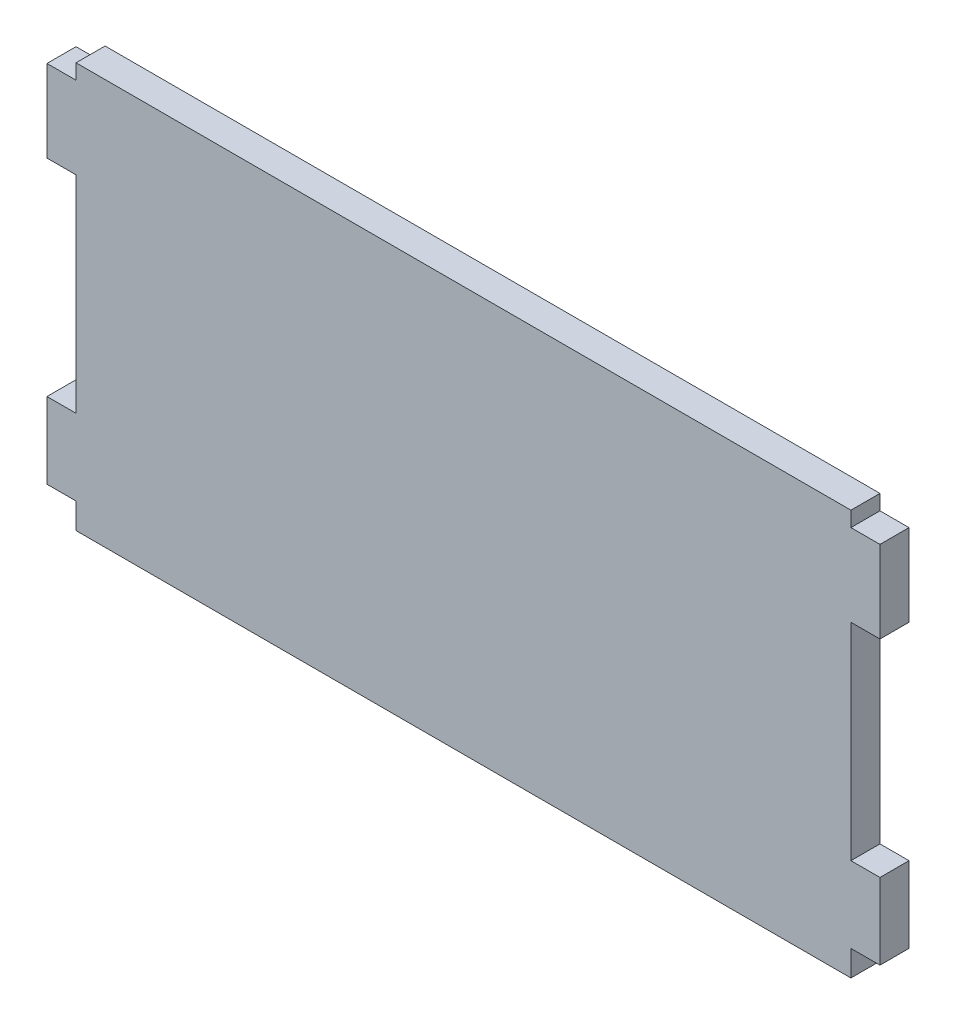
ISO-10303-21;
HEADER;
FILE_DESCRIPTION(('STEP AP214'),'2;1');
FILE_NAME('part.step','',(''),(''),'','','');
FILE_SCHEMA(('AUTOMOTIVE_DESIGN { 1 0 10303 214 1 1 1 1 }'));
ENDSEC;
DATA;
#1=APPLICATION_CONTEXT('core data for automotive mechanical design processes');
#2=APPLICATION_PROTOCOL_DEFINITION('international standard','automotive_design',2000,#1);
#3=PRODUCT_CONTEXT('',#1,'mechanical');
#4=PRODUCT('Part','Part','',(#3));
#5=PRODUCT_RELATED_PRODUCT_CATEGORY('part','',(#4));
#6=PRODUCT_DEFINITION_FORMATION('','',#4);
#7=PRODUCT_DEFINITION_CONTEXT('part definition',#1,'design');
#8=PRODUCT_DEFINITION('design','',#6,#7);
#9=PRODUCT_DEFINITION_SHAPE('','',#8);
#10=(LENGTH_UNIT() NAMED_UNIT(*) SI_UNIT(.MILLI.,.METRE.));
#11=(NAMED_UNIT(*) PLANE_ANGLE_UNIT() SI_UNIT($,.RADIAN.));
#12=(NAMED_UNIT(*) SI_UNIT($,.STERADIAN.) SOLID_ANGLE_UNIT());
#13=UNCERTAINTY_MEASURE_WITH_UNIT(LENGTH_MEASURE(1.E-05),#10,'distance_accuracy_value','');
#14=(GEOMETRIC_REPRESENTATION_CONTEXT(3) GLOBAL_UNCERTAINTY_ASSIGNED_CONTEXT((#13)) GLOBAL_UNIT_ASSIGNED_CONTEXT((#10,
#11,#12)) REPRESENTATION_CONTEXT('',''));
#15=CARTESIAN_POINT('',(0.,0.,0.));
#16=DIRECTION('',(0.,0.,1.));
#17=DIRECTION('',(1.,0.,0.));
#18=AXIS2_PLACEMENT_3D('',#15,#16,#17);
#19=CARTESIAN_POINT('',(80.,14.0214078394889,3.));
#20=DIRECTION('',(-1.,0.,0.));
#21=DIRECTION('',(0.,0.,1.));
#22=AXIS2_PLACEMENT_3D('',#19,#20,#21);
#23=PLANE('',#22);
#24=DIRECTION('',(0.,1.,0.));
#25=VECTOR('',#24,1.);
#26=CARTESIAN_POINT('',(80.,14.0214078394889,3.));
#27=LINE('',#26,#25);
#28=CARTESIAN_POINT('',(80.,-17.3181044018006,3.));
#29=VERTEX_POINT('',#28);
#30=CARTESIAN_POINT('',(80.,3.99896080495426,3.));
#31=VERTEX_POINT('',#30);
#32=EDGE_CURVE('E37',#29,#31,#27,.T.);
#33=ORIENTED_EDGE('',*,*,#32,.F.);
#34=DIRECTION('',(0.,0.,1.));
#35=VECTOR('',#34,1.);
#36=CARTESIAN_POINT('',(80.,-17.3181044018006,0.));
#37=LINE('',#36,#35);
#38=CARTESIAN_POINT('',(80.,-17.3181044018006,0.));
#39=VERTEX_POINT('',#38);
#40=EDGE_CURVE('E187',#39,#29,#37,.T.);
#41=ORIENTED_EDGE('',*,*,#40,.F.);
#42=DIRECTION('',(0.,1.,0.));
#43=VECTOR('',#42,1.);
#44=CARTESIAN_POINT('',(80.,14.0214078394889,0.));
#45=LINE('',#44,#43);
#46=CARTESIAN_POINT('',(80.,3.99896080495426,0.));
#47=VERTEX_POINT('',#46);
#48=EDGE_CURVE('E174',#39,#47,#45,.T.);
#49=ORIENTED_EDGE('',*,*,#48,.T.);
#50=DIRECTION('',(0.,0.,1.));
#51=VECTOR('',#50,1.);
#52=CARTESIAN_POINT('',(80.,3.99896080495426,0.));
#53=LINE('',#52,#51);
#54=EDGE_CURVE('E228',#47,#31,#53,.T.);
#55=ORIENTED_EDGE('',*,*,#54,.T.);
#56=EDGE_LOOP('',(#33,#41,#49,#55));
#57=FACE_BOUND('',#56,.T.);
#58=ADVANCED_FACE('F33',(#57),#23,.F.);
#59=DIRECTION('',(0.,0.,1.));
#60=VECTOR('',#59,1.);
#61=CARTESIAN_POINT('',(80.,12.4619497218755,0.));
#62=LINE('',#61,#60);
#63=CARTESIAN_POINT('',(80.,12.4619497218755,0.));
#64=VERTEX_POINT('',#63);
#65=CARTESIAN_POINT('',(80.,12.4619497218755,3.));
#66=VERTEX_POINT('',#65);
#67=EDGE_CURVE('E217',#64,#66,#62,.T.);
#68=ORIENTED_EDGE('',*,*,#67,.F.);
#69=CARTESIAN_POINT('',(80.,14.0214078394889,0.));
#70=VERTEX_POINT('',#69);
#71=EDGE_CURVE('E186',#64,#70,#45,.T.);
#72=ORIENTED_EDGE('',*,*,#71,.T.);
#73=DIRECTION('',(0.,0.,-1.));
#74=VECTOR('',#73,1.);
#75=CARTESIAN_POINT('',(80.,14.0214078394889,3.));
#76=LINE('',#75,#74);
#77=CARTESIAN_POINT('',(80.,14.0214078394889,3.));
#78=VERTEX_POINT('',#77);
#79=EDGE_CURVE('E313',#78,#70,#76,.T.);
#80=ORIENTED_EDGE('',*,*,#79,.F.);
#81=EDGE_CURVE('E296',#66,#78,#27,.T.);
#82=ORIENTED_EDGE('',*,*,#81,.F.);
#83=EDGE_LOOP('',(#68,#72,#80,#82));
#84=FACE_BOUND('',#83,.T.);
#85=ADVANCED_FACE('F319',(#84),#23,.F.);
#86=CARTESIAN_POINT('',(0.,14.0214078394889,3.));
#87=DIRECTION('',(1.,0.,0.));
#88=DIRECTION('',(0.,0.,-1.));
#89=AXIS2_PLACEMENT_3D('',#86,#87,#88);
#90=PLANE('',#89);
#91=DIRECTION('',(0.,-1.,0.));
#92=VECTOR('',#91,1.);
#93=CARTESIAN_POINT('',(0.,14.0214078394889,0.));
#94=LINE('',#93,#92);
#95=CARTESIAN_POINT('',(0.,3.99896080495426,0.));
#96=VERTEX_POINT('',#95);
#97=CARTESIAN_POINT('',(0.,-17.3181044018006,0.));
#98=VERTEX_POINT('',#97);
#99=EDGE_CURVE('E282',#96,#98,#94,.T.);
#100=ORIENTED_EDGE('',*,*,#99,.T.);
#101=DIRECTION('',(0.,0.,1.));
#102=VECTOR('',#101,1.);
#103=CARTESIAN_POINT('',(0.,-17.3181044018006,0.));
#104=LINE('',#103,#102);
#105=CARTESIAN_POINT('',(0.,-17.3181044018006,3.));
#106=VERTEX_POINT('',#105);
#107=EDGE_CURVE('E386',#98,#106,#104,.T.);
#108=ORIENTED_EDGE('',*,*,#107,.T.);
#109=DIRECTION('',(0.,-1.,0.));
#110=VECTOR('',#109,1.);
#111=CARTESIAN_POINT('',(0.,14.0214078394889,3.));
#112=LINE('',#111,#110);
#113=CARTESIAN_POINT('',(0.,3.99896080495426,3.));
#114=VERTEX_POINT('',#113);
#115=EDGE_CURVE('E265',#114,#106,#112,.T.);
#116=ORIENTED_EDGE('',*,*,#115,.F.);
#117=DIRECTION('',(0.,0.,1.));
#118=VECTOR('',#117,1.);
#119=CARTESIAN_POINT('',(0.,3.99896080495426,0.));
#120=LINE('',#119,#118);
#121=EDGE_CURVE('E359',#96,#114,#120,.T.);
#122=ORIENTED_EDGE('',*,*,#121,.F.);
#123=EDGE_LOOP('',(#100,#108,#116,#122));
#124=FACE_BOUND('',#123,.T.);
#125=ADVANCED_FACE('F328',(#124),#90,.F.);
#126=CARTESIAN_POINT('',(0.,-25.162309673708,3.));
#127=VERTEX_POINT('',#126);
#128=CARTESIAN_POINT('',(0.,-27.8080848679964,3.));
#129=VERTEX_POINT('',#128);
#130=EDGE_CURVE('E262',#127,#129,#112,.T.);
#131=ORIENTED_EDGE('',*,*,#130,.F.);
#132=DIRECTION('',(0.,0.,1.));
#133=VECTOR('',#132,1.);
#134=CARTESIAN_POINT('',(0.,-25.162309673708,0.));
#135=LINE('',#134,#133);
#136=CARTESIAN_POINT('',(0.,-25.162309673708,0.));
#137=VERTEX_POINT('',#136);
#138=EDGE_CURVE('E382',#137,#127,#135,.T.);
#139=ORIENTED_EDGE('',*,*,#138,.F.);
#140=CARTESIAN_POINT('',(0.,-27.8080848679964,0.));
#141=VERTEX_POINT('',#140);
#142=EDGE_CURVE('E266',#137,#141,#94,.T.);
#143=ORIENTED_EDGE('',*,*,#142,.T.);
#144=DIRECTION('',(0.,0.,-1.));
#145=VECTOR('',#144,1.);
#146=CARTESIAN_POINT('',(0.,-27.8080848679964,3.));
#147=LINE('',#146,#145);
#148=EDGE_CURVE('E11',#129,#141,#147,.T.);
#149=ORIENTED_EDGE('',*,*,#148,.F.);
#150=EDGE_LOOP('',(#131,#139,#143,#149));
#151=FACE_BOUND('',#150,.T.);
#152=ADVANCED_FACE('F333',(#151),#90,.F.);
#153=CARTESIAN_POINT('',(0.,14.0214078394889,0.));
#154=VERTEX_POINT('',#153);
#155=CARTESIAN_POINT('',(0.,12.4619497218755,0.));
#156=VERTEX_POINT('',#155);
#157=EDGE_CURVE('E284',#154,#156,#94,.T.);
#158=ORIENTED_EDGE('',*,*,#157,.T.);
#159=DIRECTION('',(0.,0.,1.));
#160=VECTOR('',#159,1.);
#161=CARTESIAN_POINT('',(0.,12.4619497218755,0.));
#162=LINE('',#161,#160);
#163=CARTESIAN_POINT('',(0.,12.4619497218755,3.));
#164=VERTEX_POINT('',#163);
#165=EDGE_CURVE('E347',#156,#164,#162,.T.);
#166=ORIENTED_EDGE('',*,*,#165,.T.);
#167=CARTESIAN_POINT('',(0.,14.0214078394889,3.));
#168=VERTEX_POINT('',#167);
#169=EDGE_CURVE('E279',#168,#164,#112,.T.);
#170=ORIENTED_EDGE('',*,*,#169,.F.);
#171=DIRECTION('',(0.,0.,-1.));
#172=VECTOR('',#171,1.);
#173=CARTESIAN_POINT('',(0.,14.0214078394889,3.));
#174=LINE('',#173,#172);
#175=EDGE_CURVE('E290',#168,#154,#174,.T.);
#176=ORIENTED_EDGE('',*,*,#175,.T.);
#177=EDGE_LOOP('',(#158,#166,#170,#176));
#178=FACE_BOUND('',#177,.T.);
#179=ADVANCED_FACE('F35',(#178),#90,.F.);
#180=CARTESIAN_POINT('',(0.,-27.8080848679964,3.));
#181=DIRECTION('',(0.,1.,0.));
#182=DIRECTION('',(0.,0.,1.));
#183=AXIS2_PLACEMENT_3D('',#180,#181,#182);
#184=PLANE('',#183);
#185=DIRECTION('',(1.,0.,0.));
#186=VECTOR('',#185,1.);
#187=CARTESIAN_POINT('',(0.,-27.8080848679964,0.));
#188=LINE('',#187,#186);
#189=CARTESIAN_POINT('',(80.,-27.8080848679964,0.));
#190=VERTEX_POINT('',#189);
#191=EDGE_CURVE('E252',#141,#190,#188,.T.);
#192=ORIENTED_EDGE('',*,*,#191,.T.);
#193=DIRECTION('',(0.,0.,-1.));
#194=VECTOR('',#193,1.);
#195=CARTESIAN_POINT('',(80.,-27.8080848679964,3.));
#196=LINE('',#195,#194);
#197=CARTESIAN_POINT('',(80.,-27.8080848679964,3.));
#198=VERTEX_POINT('',#197);
#199=EDGE_CURVE('E43',#198,#190,#196,.T.);
#200=ORIENTED_EDGE('',*,*,#199,.F.);
#201=DIRECTION('',(1.,0.,0.));
#202=VECTOR('',#201,1.);
#203=CARTESIAN_POINT('',(0.,-27.8080848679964,3.));
#204=LINE('',#203,#202);
#205=EDGE_CURVE('E273',#129,#198,#204,.T.);
#206=ORIENTED_EDGE('',*,*,#205,.F.);
#207=ORIENTED_EDGE('',*,*,#148,.T.);
#208=EDGE_LOOP('',(#192,#200,#206,#207));
#209=FACE_BOUND('',#208,.T.);
#210=ADVANCED_FACE('F310',(#209),#184,.F.);
#211=CARTESIAN_POINT('',(80.,-25.162309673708,0.));
#212=VERTEX_POINT('',#211);
#213=EDGE_CURVE('E185',#190,#212,#45,.T.);
#214=ORIENTED_EDGE('',*,*,#213,.T.);
#215=DIRECTION('',(0.,0.,1.));
#216=VECTOR('',#215,1.);
#217=CARTESIAN_POINT('',(80.,-25.162309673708,0.));
#218=LINE('',#217,#216);
#219=CARTESIAN_POINT('',(80.,-25.162309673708,3.));
#220=VERTEX_POINT('',#219);
#221=EDGE_CURVE('E58',#212,#220,#218,.T.);
#222=ORIENTED_EDGE('',*,*,#221,.T.);
#223=EDGE_CURVE('E291',#198,#220,#27,.T.);
#224=ORIENTED_EDGE('',*,*,#223,.F.);
#225=ORIENTED_EDGE('',*,*,#199,.T.);
#226=EDGE_LOOP('',(#214,#222,#224,#225));
#227=FACE_BOUND('',#226,.T.);
#228=ADVANCED_FACE('F315',(#227),#23,.F.);
#229=CARTESIAN_POINT('',(0.,14.0214078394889,3.));
#230=DIRECTION('',(0.,-1.,0.));
#231=DIRECTION('',(0.,0.,-1.));
#232=AXIS2_PLACEMENT_3D('',#229,#230,#231);
#233=PLANE('',#232);
#234=DIRECTION('',(-1.,0.,0.));
#235=VECTOR('',#234,1.);
#236=CARTESIAN_POINT('',(0.,14.0214078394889,0.));
#237=LINE('',#236,#235);
#238=EDGE_CURVE('E254',#70,#154,#237,.T.);
#239=ORIENTED_EDGE('',*,*,#238,.T.);
#240=ORIENTED_EDGE('',*,*,#175,.F.);
#241=DIRECTION('',(-1.,0.,0.));
#242=VECTOR('',#241,1.);
#243=CARTESIAN_POINT('',(0.,14.0214078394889,3.));
#244=LINE('',#243,#242);
#245=EDGE_CURVE('E287',#78,#168,#244,.T.);
#246=ORIENTED_EDGE('',*,*,#245,.F.);
#247=ORIENTED_EDGE('',*,*,#79,.T.);
#248=EDGE_LOOP('',(#239,#240,#246,#247));
#249=FACE_BOUND('',#248,.T.);
#250=ADVANCED_FACE('F317',(#249),#233,.F.);
#251=CARTESIAN_POINT('',(0.,0.,3.));
#252=DIRECTION('',(0.,0.,1.));
#253=DIRECTION('',(1.,0.,0.));
#254=AXIS2_PLACEMENT_3D('',#251,#252,#253);
#255=PLANE('',#254);
#256=ORIENTED_EDGE('',*,*,#169,.T.);
#257=DIRECTION('',(-1.,0.,0.));
#258=VECTOR('',#257,1.);
#259=CARTESIAN_POINT('',(-3.,12.4619497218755,3.));
#260=LINE('',#259,#258);
#261=CARTESIAN_POINT('',(-3.,12.4619497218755,3.));
#262=VERTEX_POINT('',#261);
#263=EDGE_CURVE('E379',#164,#262,#260,.T.);
#264=ORIENTED_EDGE('',*,*,#263,.T.);
#265=DIRECTION('',(0.,-1.,0.));
#266=VECTOR('',#265,1.);
#267=CARTESIAN_POINT('',(-3.,12.4619497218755,3.));
#268=LINE('',#267,#266);
#269=CARTESIAN_POINT('',(-3.,3.99896080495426,3.));
#270=VERTEX_POINT('',#269);
#271=EDGE_CURVE('E373',#262,#270,#268,.T.);
#272=ORIENTED_EDGE('',*,*,#271,.T.);
#273=DIRECTION('',(1.,0.,0.));
#274=VECTOR('',#273,1.);
#275=CARTESIAN_POINT('',(-3.,3.99896080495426,3.));
#276=LINE('',#275,#274);
#277=EDGE_CURVE('E376',#270,#114,#276,.T.);
#278=ORIENTED_EDGE('',*,*,#277,.T.);
#279=ORIENTED_EDGE('',*,*,#115,.T.);
#280=DIRECTION('',(-1.,0.,0.));
#281=VECTOR('',#280,1.);
#282=CARTESIAN_POINT('',(-3.,-17.3181044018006,3.));
#283=LINE('',#282,#281);
#284=CARTESIAN_POINT('',(-3.,-17.3181044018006,3.));
#285=VERTEX_POINT('',#284);
#286=EDGE_CURVE('E389',#106,#285,#283,.T.);
#287=ORIENTED_EDGE('',*,*,#286,.T.);
#288=DIRECTION('',(0.,-1.,0.));
#289=VECTOR('',#288,1.);
#290=CARTESIAN_POINT('',(-3.,-17.3181044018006,3.));
#291=LINE('',#290,#289);
#292=CARTESIAN_POINT('',(-3.,-25.162309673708,3.));
#293=VERTEX_POINT('',#292);
#294=EDGE_CURVE('E225',#285,#293,#291,.T.);
#295=ORIENTED_EDGE('',*,*,#294,.T.);
#296=DIRECTION('',(1.,0.,0.));
#297=VECTOR('',#296,1.);
#298=CARTESIAN_POINT('',(-3.,-25.162309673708,3.));
#299=LINE('',#298,#297);
#300=EDGE_CURVE('E393',#293,#127,#299,.T.);
#301=ORIENTED_EDGE('',*,*,#300,.T.);
#302=ORIENTED_EDGE('',*,*,#130,.T.);
#303=ORIENTED_EDGE('',*,*,#205,.T.);
#304=ORIENTED_EDGE('',*,*,#223,.T.);
#305=DIRECTION('',(1.,0.,0.));
#306=VECTOR('',#305,1.);
#307=CARTESIAN_POINT('',(83.,-25.162309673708,3.));
#308=LINE('',#307,#306);
#309=CARTESIAN_POINT('',(83.,-25.162309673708,3.));
#310=VERTEX_POINT('',#309);
#311=EDGE_CURVE('E201',#220,#310,#308,.T.);
#312=ORIENTED_EDGE('',*,*,#311,.T.);
#313=DIRECTION('',(0.,1.,0.));
#314=VECTOR('',#313,1.);
#315=CARTESIAN_POINT('',(83.,-17.3181044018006,3.));
#316=LINE('',#315,#314);
#317=CARTESIAN_POINT('',(83.,-17.3181044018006,3.));
#318=VERTEX_POINT('',#317);
#319=EDGE_CURVE('E196',#310,#318,#316,.T.);
#320=ORIENTED_EDGE('',*,*,#319,.T.);
#321=DIRECTION('',(-1.,0.,0.));
#322=VECTOR('',#321,1.);
#323=CARTESIAN_POINT('',(83.,-17.3181044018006,3.));
#324=LINE('',#323,#322);
#325=EDGE_CURVE('E205',#318,#29,#324,.T.);
#326=ORIENTED_EDGE('',*,*,#325,.T.);
#327=ORIENTED_EDGE('',*,*,#32,.T.);
#328=DIRECTION('',(1.,0.,0.));
#329=VECTOR('',#328,1.);
#330=CARTESIAN_POINT('',(83.,3.99896080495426,3.));
#331=LINE('',#330,#329);
#332=CARTESIAN_POINT('',(83.,3.99896080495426,3.));
#333=VERTEX_POINT('',#332);
#334=EDGE_CURVE('E222',#31,#333,#331,.T.);
#335=ORIENTED_EDGE('',*,*,#334,.T.);
#336=DIRECTION('',(0.,1.,0.));
#337=VECTOR('',#336,1.);
#338=CARTESIAN_POINT('',(83.,12.4619497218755,3.));
#339=LINE('',#338,#337);
#340=CARTESIAN_POINT('',(83.,12.4619497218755,3.));
#341=VERTEX_POINT('',#340);
#342=EDGE_CURVE('E218',#333,#341,#339,.T.);
#343=ORIENTED_EDGE('',*,*,#342,.T.);
#344=DIRECTION('',(-1.,0.,0.));
#345=VECTOR('',#344,1.);
#346=CARTESIAN_POINT('',(83.,12.4619497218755,3.));
#347=LINE('',#346,#345);
#348=EDGE_CURVE('E210',#341,#66,#347,.T.);
#349=ORIENTED_EDGE('',*,*,#348,.T.);
#350=ORIENTED_EDGE('',*,*,#81,.T.);
#351=ORIENTED_EDGE('',*,*,#245,.T.);
#352=EDGE_LOOP('',(#256,#264,#272,#278,#279,#287,#295,#301,#302,#303,#304,#312,#320,#326,#327,
#335,#343,#349,#350,#351));
#353=FACE_BOUND('',#352,.T.);
#354=ADVANCED_FACE('F305',(#353),#255,.T.);
#355=CARTESIAN_POINT('',(0.,0.,0.));
#356=DIRECTION('',(0.,0.,1.));
#357=DIRECTION('',(1.,0.,0.));
#358=AXIS2_PLACEMENT_3D('',#355,#356,#357);
#359=PLANE('',#358);
#360=ORIENTED_EDGE('',*,*,#157,.F.);
#361=ORIENTED_EDGE('',*,*,#238,.F.);
#362=ORIENTED_EDGE('',*,*,#71,.F.);
#363=DIRECTION('',(-1.,0.,0.));
#364=VECTOR('',#363,1.);
#365=CARTESIAN_POINT('',(83.,12.4619497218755,0.));
#366=LINE('',#365,#364);
#367=CARTESIAN_POINT('',(83.,12.4619497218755,0.));
#368=VERTEX_POINT('',#367);
#369=EDGE_CURVE('E221',#368,#64,#366,.T.);
#370=ORIENTED_EDGE('',*,*,#369,.F.);
#371=DIRECTION('',(0.,1.,0.));
#372=VECTOR('',#371,1.);
#373=CARTESIAN_POINT('',(83.,12.4619497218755,0.));
#374=LINE('',#373,#372);
#375=CARTESIAN_POINT('',(83.,3.99896080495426,0.));
#376=VERTEX_POINT('',#375);
#377=EDGE_CURVE('E214',#376,#368,#374,.T.);
#378=ORIENTED_EDGE('',*,*,#377,.F.);
#379=DIRECTION('',(1.,0.,0.));
#380=VECTOR('',#379,1.);
#381=CARTESIAN_POINT('',(83.,3.99896080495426,0.));
#382=LINE('',#381,#380);
#383=EDGE_CURVE('E183',#47,#376,#382,.T.);
#384=ORIENTED_EDGE('',*,*,#383,.F.);
#385=ORIENTED_EDGE('',*,*,#48,.F.);
#386=DIRECTION('',(-1.,0.,0.));
#387=VECTOR('',#386,1.);
#388=CARTESIAN_POINT('',(83.,-17.3181044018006,0.));
#389=LINE('',#388,#387);
#390=CARTESIAN_POINT('',(83.,-17.3181044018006,0.));
#391=VERTEX_POINT('',#390);
#392=EDGE_CURVE('E179',#391,#39,#389,.T.);
#393=ORIENTED_EDGE('',*,*,#392,.F.);
#394=DIRECTION('',(0.,1.,0.));
#395=VECTOR('',#394,1.);
#396=CARTESIAN_POINT('',(83.,-17.3181044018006,0.));
#397=LINE('',#396,#395);
#398=CARTESIAN_POINT('',(83.,-25.162309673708,0.));
#399=VERTEX_POINT('',#398);
#400=EDGE_CURVE('E191',#399,#391,#397,.T.);
#401=ORIENTED_EDGE('',*,*,#400,.F.);
#402=DIRECTION('',(1.,0.,0.));
#403=VECTOR('',#402,1.);
#404=CARTESIAN_POINT('',(83.,-25.162309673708,0.));
#405=LINE('',#404,#403);
#406=EDGE_CURVE('E195',#212,#399,#405,.T.);
#407=ORIENTED_EDGE('',*,*,#406,.F.);
#408=ORIENTED_EDGE('',*,*,#213,.F.);
#409=ORIENTED_EDGE('',*,*,#191,.F.);
#410=ORIENTED_EDGE('',*,*,#142,.F.);
#411=DIRECTION('',(1.,0.,0.));
#412=VECTOR('',#411,1.);
#413=CARTESIAN_POINT('',(-3.,-25.162309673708,0.));
#414=LINE('',#413,#412);
#415=CARTESIAN_POINT('',(-3.,-25.162309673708,0.));
#416=VERTEX_POINT('',#415);
#417=EDGE_CURVE('E399',#416,#137,#414,.T.);
#418=ORIENTED_EDGE('',*,*,#417,.F.);
#419=DIRECTION('',(0.,-1.,0.));
#420=VECTOR('',#419,1.);
#421=CARTESIAN_POINT('',(-3.,-17.3181044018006,0.));
#422=LINE('',#421,#420);
#423=CARTESIAN_POINT('',(-3.,-17.3181044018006,0.));
#424=VERTEX_POINT('',#423);
#425=EDGE_CURVE('E392',#424,#416,#422,.T.);
#426=ORIENTED_EDGE('',*,*,#425,.F.);
#427=DIRECTION('',(-1.,0.,0.));
#428=VECTOR('',#427,1.);
#429=CARTESIAN_POINT('',(-3.,-17.3181044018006,0.));
#430=LINE('',#429,#428);
#431=EDGE_CURVE('E383',#98,#424,#430,.T.);
#432=ORIENTED_EDGE('',*,*,#431,.F.);
#433=ORIENTED_EDGE('',*,*,#99,.F.);
#434=DIRECTION('',(1.,0.,0.));
#435=VECTOR('',#434,1.);
#436=CARTESIAN_POINT('',(-3.,3.99896080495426,0.));
#437=LINE('',#436,#435);
#438=CARTESIAN_POINT('',(-3.,3.99896080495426,0.));
#439=VERTEX_POINT('',#438);
#440=EDGE_CURVE('E357',#439,#96,#437,.T.);
#441=ORIENTED_EDGE('',*,*,#440,.F.);
#442=DIRECTION('',(0.,-1.,0.));
#443=VECTOR('',#442,1.);
#444=CARTESIAN_POINT('',(-3.,12.4619497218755,0.));
#445=LINE('',#444,#443);
#446=CARTESIAN_POINT('',(-3.,12.4619497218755,0.));
#447=VERTEX_POINT('',#446);
#448=EDGE_CURVE('E355',#447,#439,#445,.T.);
#449=ORIENTED_EDGE('',*,*,#448,.F.);
#450=DIRECTION('',(-1.,0.,0.));
#451=VECTOR('',#450,1.);
#452=CARTESIAN_POINT('',(-3.,12.4619497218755,0.));
#453=LINE('',#452,#451);
#454=EDGE_CURVE('E352',#156,#447,#453,.T.);
#455=ORIENTED_EDGE('',*,*,#454,.F.);
#456=EDGE_LOOP('',(#360,#361,#362,#370,#378,#384,#385,#393,#401,#407,#408,#409,#410,#418,#426,
#432,#433,#441,#449,#455));
#457=FACE_BOUND('',#456,.T.);
#458=ADVANCED_FACE('F176',(#457),#359,.F.);
#459=CARTESIAN_POINT('',(-3.,12.4619497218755,0.));
#460=DIRECTION('',(-1.,0.,0.));
#461=DIRECTION('',(0.,0.,1.));
#462=AXIS2_PLACEMENT_3D('',#459,#460,#461);
#463=PLANE('',#462);
#464=ORIENTED_EDGE('',*,*,#271,.F.);
#465=DIRECTION('',(0.,0.,1.));
#466=VECTOR('',#465,1.);
#467=CARTESIAN_POINT('',(-3.,12.4619497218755,0.));
#468=LINE('',#467,#466);
#469=EDGE_CURVE('E371',#447,#262,#468,.T.);
#470=ORIENTED_EDGE('',*,*,#469,.F.);
#471=ORIENTED_EDGE('',*,*,#448,.T.);
#472=DIRECTION('',(0.,0.,1.));
#473=VECTOR('',#472,1.);
#474=CARTESIAN_POINT('',(-3.,3.99896080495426,0.));
#475=LINE('',#474,#473);
#476=EDGE_CURVE('E271',#439,#270,#475,.T.);
#477=ORIENTED_EDGE('',*,*,#476,.T.);
#478=EDGE_LOOP('',(#464,#470,#471,#477));
#479=FACE_BOUND('',#478,.T.);
#480=ADVANCED_FACE('F428',(#479),#463,.T.);
#481=CARTESIAN_POINT('',(-3.,12.4619497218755,0.));
#482=DIRECTION('',(0.,1.,0.));
#483=DIRECTION('',(0.,0.,1.));
#484=AXIS2_PLACEMENT_3D('',#481,#482,#483);
#485=PLANE('',#484);
#486=ORIENTED_EDGE('',*,*,#263,.F.);
#487=ORIENTED_EDGE('',*,*,#165,.F.);
#488=ORIENTED_EDGE('',*,*,#454,.T.);
#489=ORIENTED_EDGE('',*,*,#469,.T.);
#490=EDGE_LOOP('',(#486,#487,#488,#489));
#491=FACE_BOUND('',#490,.T.);
#492=ADVANCED_FACE('F426',(#491),#485,.T.);
#493=CARTESIAN_POINT('',(-3.,3.99896080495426,0.));
#494=DIRECTION('',(0.,-1.,0.));
#495=DIRECTION('',(0.,0.,-1.));
#496=AXIS2_PLACEMENT_3D('',#493,#494,#495);
#497=PLANE('',#496);
#498=ORIENTED_EDGE('',*,*,#277,.F.);
#499=ORIENTED_EDGE('',*,*,#476,.F.);
#500=ORIENTED_EDGE('',*,*,#440,.T.);
#501=ORIENTED_EDGE('',*,*,#121,.T.);
#502=EDGE_LOOP('',(#498,#499,#500,#501));
#503=FACE_BOUND('',#502,.T.);
#504=ADVANCED_FACE('F429',(#503),#497,.T.);
#505=CARTESIAN_POINT('',(-3.,-17.3181044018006,0.));
#506=DIRECTION('',(-1.,0.,0.));
#507=DIRECTION('',(0.,0.,1.));
#508=AXIS2_PLACEMENT_3D('',#505,#506,#507);
#509=PLANE('',#508);
#510=ORIENTED_EDGE('',*,*,#294,.F.);
#511=DIRECTION('',(0.,0.,1.));
#512=VECTOR('',#511,1.);
#513=CARTESIAN_POINT('',(-3.,-17.3181044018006,0.));
#514=LINE('',#513,#512);
#515=EDGE_CURVE('E377',#424,#285,#514,.T.);
#516=ORIENTED_EDGE('',*,*,#515,.F.);
#517=ORIENTED_EDGE('',*,*,#425,.T.);
#518=DIRECTION('',(0.,0.,1.));
#519=VECTOR('',#518,1.);
#520=CARTESIAN_POINT('',(-3.,-25.162309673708,0.));
#521=LINE('',#520,#519);
#522=EDGE_CURVE('E380',#416,#293,#521,.T.);
#523=ORIENTED_EDGE('',*,*,#522,.T.);
#524=EDGE_LOOP('',(#510,#516,#517,#523));
#525=FACE_BOUND('',#524,.T.);
#526=ADVANCED_FACE('F405',(#525),#509,.T.);
#527=CARTESIAN_POINT('',(-3.,-17.3181044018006,0.));
#528=DIRECTION('',(0.,1.,0.));
#529=DIRECTION('',(0.,0.,1.));
#530=AXIS2_PLACEMENT_3D('',#527,#528,#529);
#531=PLANE('',#530);
#532=ORIENTED_EDGE('',*,*,#286,.F.);
#533=ORIENTED_EDGE('',*,*,#107,.F.);
#534=ORIENTED_EDGE('',*,*,#431,.T.);
#535=ORIENTED_EDGE('',*,*,#515,.T.);
#536=EDGE_LOOP('',(#532,#533,#534,#535));
#537=FACE_BOUND('',#536,.T.);
#538=ADVANCED_FACE('F413',(#537),#531,.T.);
#539=CARTESIAN_POINT('',(-3.,-25.162309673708,0.));
#540=DIRECTION('',(0.,-1.,0.));
#541=DIRECTION('',(0.,0.,-1.));
#542=AXIS2_PLACEMENT_3D('',#539,#540,#541);
#543=PLANE('',#542);
#544=ORIENTED_EDGE('',*,*,#300,.F.);
#545=ORIENTED_EDGE('',*,*,#522,.F.);
#546=ORIENTED_EDGE('',*,*,#417,.T.);
#547=ORIENTED_EDGE('',*,*,#138,.T.);
#548=EDGE_LOOP('',(#544,#545,#546,#547));
#549=FACE_BOUND('',#548,.T.);
#550=ADVANCED_FACE('F475',(#549),#543,.T.);
#551=CARTESIAN_POINT('',(83.,12.4619497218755,0.));
#552=DIRECTION('',(0.,1.,0.));
#553=DIRECTION('',(0.,0.,1.));
#554=AXIS2_PLACEMENT_3D('',#551,#552,#553);
#555=PLANE('',#554);
#556=ORIENTED_EDGE('',*,*,#348,.F.);
#557=DIRECTION('',(0.,0.,1.));
#558=VECTOR('',#557,1.);
#559=CARTESIAN_POINT('',(83.,12.4619497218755,0.));
#560=LINE('',#559,#558);
#561=EDGE_CURVE('E223',#368,#341,#560,.T.);
#562=ORIENTED_EDGE('',*,*,#561,.F.);
#563=ORIENTED_EDGE('',*,*,#369,.T.);
#564=ORIENTED_EDGE('',*,*,#67,.T.);
#565=EDGE_LOOP('',(#556,#562,#563,#564));
#566=FACE_BOUND('',#565,.T.);
#567=ADVANCED_FACE('F484',(#566),#555,.T.);
#568=CARTESIAN_POINT('',(83.,12.4619497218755,0.));
#569=DIRECTION('',(1.,0.,0.));
#570=DIRECTION('',(0.,0.,-1.));
#571=AXIS2_PLACEMENT_3D('',#568,#569,#570);
#572=PLANE('',#571);
#573=ORIENTED_EDGE('',*,*,#342,.F.);
#574=DIRECTION('',(0.,0.,1.));
#575=VECTOR('',#574,1.);
#576=CARTESIAN_POINT('',(83.,3.99896080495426,0.));
#577=LINE('',#576,#575);
#578=EDGE_CURVE('E226',#376,#333,#577,.T.);
#579=ORIENTED_EDGE('',*,*,#578,.F.);
#580=ORIENTED_EDGE('',*,*,#377,.T.);
#581=ORIENTED_EDGE('',*,*,#561,.T.);
#582=EDGE_LOOP('',(#573,#579,#580,#581));
#583=FACE_BOUND('',#582,.T.);
#584=ADVANCED_FACE('F494',(#583),#572,.T.);
#585=CARTESIAN_POINT('',(83.,3.99896080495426,0.));
#586=DIRECTION('',(0.,-1.,0.));
#587=DIRECTION('',(0.,0.,-1.));
#588=AXIS2_PLACEMENT_3D('',#585,#586,#587);
#589=PLANE('',#588);
#590=ORIENTED_EDGE('',*,*,#334,.F.);
#591=ORIENTED_EDGE('',*,*,#54,.F.);
#592=ORIENTED_EDGE('',*,*,#383,.T.);
#593=ORIENTED_EDGE('',*,*,#578,.T.);
#594=EDGE_LOOP('',(#590,#591,#592,#593));
#595=FACE_BOUND('',#594,.T.);
#596=ADVANCED_FACE('F503',(#595),#589,.T.);
#597=CARTESIAN_POINT('',(83.,-17.3181044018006,0.));
#598=DIRECTION('',(0.,1.,0.));
#599=DIRECTION('',(0.,0.,1.));
#600=AXIS2_PLACEMENT_3D('',#597,#598,#599);
#601=PLANE('',#600);
#602=ORIENTED_EDGE('',*,*,#325,.F.);
#603=DIRECTION('',(0.,0.,1.));
#604=VECTOR('',#603,1.);
#605=CARTESIAN_POINT('',(83.,-17.3181044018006,0.));
#606=LINE('',#605,#604);
#607=EDGE_CURVE('E194',#391,#318,#606,.T.);
#608=ORIENTED_EDGE('',*,*,#607,.F.);
#609=ORIENTED_EDGE('',*,*,#392,.T.);
#610=ORIENTED_EDGE('',*,*,#40,.T.);
#611=EDGE_LOOP('',(#602,#608,#609,#610));
#612=FACE_BOUND('',#611,.T.);
#613=ADVANCED_FACE('F193',(#612),#601,.T.);
#614=CARTESIAN_POINT('',(83.,-17.3181044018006,0.));
#615=DIRECTION('',(1.,0.,0.));
#616=DIRECTION('',(0.,0.,-1.));
#617=AXIS2_PLACEMENT_3D('',#614,#615,#616);
#618=PLANE('',#617);
#619=ORIENTED_EDGE('',*,*,#319,.F.);
#620=DIRECTION('',(0.,0.,1.));
#621=VECTOR('',#620,1.);
#622=CARTESIAN_POINT('',(83.,-25.162309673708,0.));
#623=LINE('',#622,#621);
#624=EDGE_CURVE('E211',#399,#310,#623,.T.);
#625=ORIENTED_EDGE('',*,*,#624,.F.);
#626=ORIENTED_EDGE('',*,*,#400,.T.);
#627=ORIENTED_EDGE('',*,*,#607,.T.);
#628=EDGE_LOOP('',(#619,#625,#626,#627));
#629=FACE_BOUND('',#628,.T.);
#630=ADVANCED_FACE('F522',(#629),#618,.T.);
#631=CARTESIAN_POINT('',(83.,-25.162309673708,0.));
#632=DIRECTION('',(0.,-1.,0.));
#633=DIRECTION('',(0.,0.,-1.));
#634=AXIS2_PLACEMENT_3D('',#631,#632,#633);
#635=PLANE('',#634);
#636=ORIENTED_EDGE('',*,*,#311,.F.);
#637=ORIENTED_EDGE('',*,*,#221,.F.);
#638=ORIENTED_EDGE('',*,*,#406,.T.);
#639=ORIENTED_EDGE('',*,*,#624,.T.);
#640=EDGE_LOOP('',(#636,#637,#638,#639));
#641=FACE_BOUND('',#640,.T.);
#642=ADVANCED_FACE('F531',(#641),#635,.T.);
#643=CLOSED_SHELL('',(#58,#85,#125,#152,#179,#210,#228,#250,#354,#458,#480,#492,#504,#526,#538,
#550,#567,#584,#596,#613,#630,#642));
#644=MANIFOLD_SOLID_BREP('B2',#643);
#645=ADVANCED_BREP_SHAPE_REPRESENTATION('',(#18,#644),#14);
#646=SHAPE_DEFINITION_REPRESENTATION(#9,#645);
ENDSEC;
END-ISO-10303-21;
